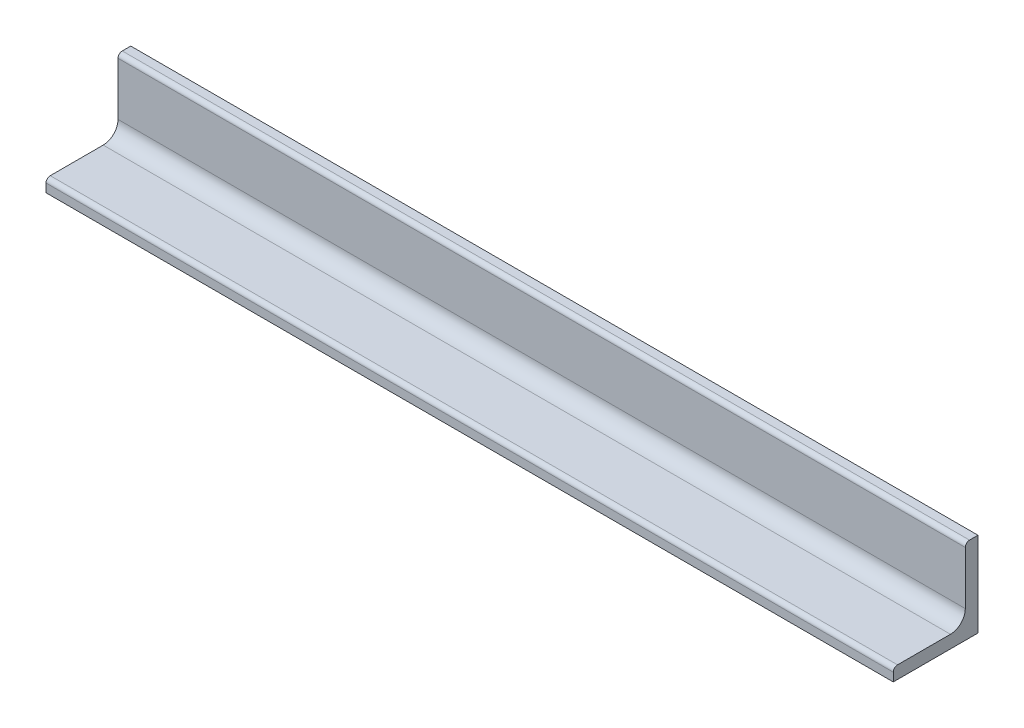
ISO-10303-21;
HEADER;
FILE_DESCRIPTION(('STEP AP214'),'2;1');
FILE_NAME('part.step','',(''),(''),'','','');
FILE_SCHEMA(('AUTOMOTIVE_DESIGN { 1 0 10303 214 1 1 1 1 }'));
ENDSEC;
DATA;
#1=APPLICATION_CONTEXT('core data for automotive mechanical design processes');
#2=APPLICATION_PROTOCOL_DEFINITION('international standard','automotive_design',2000,#1);
#3=PRODUCT_CONTEXT('',#1,'mechanical');
#4=PRODUCT('Part','Part','',(#3));
#5=PRODUCT_RELATED_PRODUCT_CATEGORY('part','',(#4));
#6=PRODUCT_DEFINITION_FORMATION('','',#4);
#7=PRODUCT_DEFINITION_CONTEXT('part definition',#1,'design');
#8=PRODUCT_DEFINITION('design','',#6,#7);
#9=PRODUCT_DEFINITION_SHAPE('','',#8);
#10=(LENGTH_UNIT() NAMED_UNIT(*) SI_UNIT(.MILLI.,.METRE.));
#11=(NAMED_UNIT(*) PLANE_ANGLE_UNIT() SI_UNIT($,.RADIAN.));
#12=(NAMED_UNIT(*) SI_UNIT($,.STERADIAN.) SOLID_ANGLE_UNIT());
#13=UNCERTAINTY_MEASURE_WITH_UNIT(LENGTH_MEASURE(1.E-05),#10,'distance_accuracy_value','');
#14=(GEOMETRIC_REPRESENTATION_CONTEXT(3) GLOBAL_UNCERTAINTY_ASSIGNED_CONTEXT((#13)) GLOBAL_UNIT_ASSIGNED_CONTEXT((#10,
#11,#12)) REPRESENTATION_CONTEXT('',''));
#15=CARTESIAN_POINT('',(0.,0.,0.));
#16=DIRECTION('',(0.,0.,1.));
#17=DIRECTION('',(1.,0.,0.));
#18=AXIS2_PLACEMENT_3D('',#15,#16,#17);
#19=CARTESIAN_POINT('',(200.,0.,20.));
#20=DIRECTION('',(0.,0.,-1.));
#21=DIRECTION('',(0.,1.,0.));
#22=AXIS2_PLACEMENT_3D('',#19,#20,#21);
#23=PLANE('',#22);
#24=DIRECTION('',(0.,-1.,0.));
#25=VECTOR('',#24,1.);
#26=CARTESIAN_POINT('',(0.,0.,20.));
#27=LINE('',#26,#25);
#28=CARTESIAN_POINT('',(0.,1.99999999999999,20.));
#29=VERTEX_POINT('',#28);
#30=CARTESIAN_POINT('',(0.,0.,20.));
#31=VERTEX_POINT('',#30);
#32=EDGE_CURVE('E135',#29,#31,#27,.T.);
#33=ORIENTED_EDGE('',*,*,#32,.T.);
#34=DIRECTION('',(-1.,0.,0.));
#35=VECTOR('',#34,1.);
#36=CARTESIAN_POINT('',(200.,0.,20.));
#37=LINE('',#36,#35);
#38=CARTESIAN_POINT('',(200.,0.,20.));
#39=VERTEX_POINT('',#38);
#40=EDGE_CURVE('E11',#39,#31,#37,.T.);
#41=ORIENTED_EDGE('',*,*,#40,.F.);
#42=DIRECTION('',(0.,-1.,0.));
#43=VECTOR('',#42,1.);
#44=CARTESIAN_POINT('',(200.,0.,20.));
#45=LINE('',#44,#43);
#46=CARTESIAN_POINT('',(200.,1.99999999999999,20.));
#47=VERTEX_POINT('',#46);
#48=EDGE_CURVE('E151',#47,#39,#45,.T.);
#49=ORIENTED_EDGE('',*,*,#48,.F.);
#50=DIRECTION('',(-1.,0.,0.));
#51=VECTOR('',#50,1.);
#52=CARTESIAN_POINT('',(200.,1.99999999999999,20.));
#53=LINE('',#52,#51);
#54=EDGE_CURVE('E131',#47,#29,#53,.T.);
#55=ORIENTED_EDGE('',*,*,#54,.T.);
#56=EDGE_LOOP('',(#33,#41,#49,#55));
#57=FACE_BOUND('',#56,.T.);
#58=ADVANCED_FACE('F33',(#57),#23,.F.);
#59=CARTESIAN_POINT('',(200.,0.,20.));
#60=DIRECTION('',(0.,1.,0.));
#61=DIRECTION('',(0.,0.,1.));
#62=AXIS2_PLACEMENT_3D('',#59,#60,#61);
#63=PLANE('',#62);
#64=DIRECTION('',(0.,0.,-1.));
#65=VECTOR('',#64,1.);
#66=CARTESIAN_POINT('',(0.,0.,20.));
#67=LINE('',#66,#65);
#68=CARTESIAN_POINT('',(0.,0.,0.));
#69=VERTEX_POINT('',#68);
#70=EDGE_CURVE('E138',#31,#69,#67,.T.);
#71=ORIENTED_EDGE('',*,*,#70,.T.);
#72=DIRECTION('',(-1.,0.,0.));
#73=VECTOR('',#72,1.);
#74=CARTESIAN_POINT('',(200.,0.,0.));
#75=LINE('',#74,#73);
#76=CARTESIAN_POINT('',(200.,0.,0.));
#77=VERTEX_POINT('',#76);
#78=EDGE_CURVE('E41',#77,#69,#75,.T.);
#79=ORIENTED_EDGE('',*,*,#78,.F.);
#80=DIRECTION('',(0.,0.,-1.));
#81=VECTOR('',#80,1.);
#82=CARTESIAN_POINT('',(200.,0.,20.));
#83=LINE('',#82,#81);
#84=EDGE_CURVE('E95',#39,#77,#83,.T.);
#85=ORIENTED_EDGE('',*,*,#84,.F.);
#86=ORIENTED_EDGE('',*,*,#40,.T.);
#87=EDGE_LOOP('',(#71,#79,#85,#86));
#88=FACE_BOUND('',#87,.T.);
#89=ADVANCED_FACE('F194',(#88),#63,.F.);
#90=CARTESIAN_POINT('',(200.,0.,0.));
#91=DIRECTION('',(0.,0.,1.));
#92=DIRECTION('',(1.,0.,0.));
#93=AXIS2_PLACEMENT_3D('',#90,#91,#92);
#94=PLANE('',#93);
#95=DIRECTION('',(0.,1.,0.));
#96=VECTOR('',#95,1.);
#97=CARTESIAN_POINT('',(0.,0.,0.));
#98=LINE('',#97,#96);
#99=CARTESIAN_POINT('',(0.,20.,0.));
#100=VERTEX_POINT('',#99);
#101=EDGE_CURVE('E140',#69,#100,#98,.T.);
#102=ORIENTED_EDGE('',*,*,#101,.T.);
#103=DIRECTION('',(-1.,0.,0.));
#104=VECTOR('',#103,1.);
#105=CARTESIAN_POINT('',(200.,20.,0.));
#106=LINE('',#105,#104);
#107=CARTESIAN_POINT('',(200.,20.,0.));
#108=VERTEX_POINT('',#107);
#109=EDGE_CURVE('E161',#108,#100,#106,.T.);
#110=ORIENTED_EDGE('',*,*,#109,.F.);
#111=DIRECTION('',(0.,1.,0.));
#112=VECTOR('',#111,1.);
#113=CARTESIAN_POINT('',(200.,0.,0.));
#114=LINE('',#113,#112);
#115=EDGE_CURVE('E169',#77,#108,#114,.T.);
#116=ORIENTED_EDGE('',*,*,#115,.F.);
#117=ORIENTED_EDGE('',*,*,#78,.T.);
#118=EDGE_LOOP('',(#102,#110,#116,#117));
#119=FACE_BOUND('',#118,.T.);
#120=ADVANCED_FACE('F167',(#119),#94,.F.);
#121=CARTESIAN_POINT('',(200.,20.,0.));
#122=DIRECTION('',(0.,-1.,0.));
#123=DIRECTION('',(0.,0.,-1.));
#124=AXIS2_PLACEMENT_3D('',#121,#122,#123);
#125=PLANE('',#124);
#126=DIRECTION('',(0.,0.,1.));
#127=VECTOR('',#126,1.);
#128=CARTESIAN_POINT('',(0.,20.,0.));
#129=LINE('',#128,#127);
#130=CARTESIAN_POINT('',(0.,20.,1.99999999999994));
#131=VERTEX_POINT('',#130);
#132=EDGE_CURVE('E142',#100,#131,#129,.T.);
#133=ORIENTED_EDGE('',*,*,#132,.T.);
#134=DIRECTION('',(-1.,0.,0.));
#135=VECTOR('',#134,1.);
#136=CARTESIAN_POINT('',(200.,20.,1.99999999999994));
#137=LINE('',#136,#135);
#138=CARTESIAN_POINT('',(200.,20.,1.99999999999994));
#139=VERTEX_POINT('',#138);
#140=EDGE_CURVE('E158',#139,#131,#137,.T.);
#141=ORIENTED_EDGE('',*,*,#140,.F.);
#142=DIRECTION('',(0.,0.,1.));
#143=VECTOR('',#142,1.);
#144=CARTESIAN_POINT('',(200.,20.,0.));
#145=LINE('',#144,#143);
#146=EDGE_CURVE('E185',#108,#139,#145,.T.);
#147=ORIENTED_EDGE('',*,*,#146,.F.);
#148=ORIENTED_EDGE('',*,*,#109,.T.);
#149=EDGE_LOOP('',(#133,#141,#147,#148));
#150=FACE_BOUND('',#149,.T.);
#151=ADVANCED_FACE('F178',(#150),#125,.F.);
#152=CARTESIAN_POINT('',(200.,19.,1.99999999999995));
#153=DIRECTION('',(-1.,0.,0.));
#154=DIRECTION('',(0.,0.,1.));
#155=AXIS2_PLACEMENT_3D('',#152,#153,#154);
#156=CYLINDRICAL_SURFACE('',#155,1.);
#157=CARTESIAN_POINT('',(0.,19.,1.99999999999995));
#158=DIRECTION('',(1.,0.,0.));
#159=DIRECTION('',(0.,0.,-1.));
#160=AXIS2_PLACEMENT_3D('',#157,#158,#159);
#161=CIRCLE('',#160,1.);
#162=CARTESIAN_POINT('',(0.,19.,2.99999999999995));
#163=VERTEX_POINT('',#162);
#164=EDGE_CURVE('E144',#131,#163,#161,.T.);
#165=ORIENTED_EDGE('',*,*,#164,.T.);
#166=DIRECTION('',(-1.,0.,0.));
#167=VECTOR('',#166,1.);
#168=CARTESIAN_POINT('',(200.,19.,2.99999999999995));
#169=LINE('',#168,#167);
#170=CARTESIAN_POINT('',(200.,19.,2.99999999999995));
#171=VERTEX_POINT('',#170);
#172=EDGE_CURVE('E155',#171,#163,#169,.T.);
#173=ORIENTED_EDGE('',*,*,#172,.F.);
#174=CARTESIAN_POINT('',(200.,19.,1.99999999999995));
#175=DIRECTION('',(1.,0.,0.));
#176=DIRECTION('',(0.,0.,-1.));
#177=AXIS2_PLACEMENT_3D('',#174,#175,#176);
#178=CIRCLE('',#177,1.);
#179=EDGE_CURVE('E184',#139,#171,#178,.T.);
#180=ORIENTED_EDGE('',*,*,#179,.F.);
#181=ORIENTED_EDGE('',*,*,#140,.T.);
#182=EDGE_LOOP('',(#165,#173,#180,#181));
#183=FACE_BOUND('',#182,.T.);
#184=ADVANCED_FACE('F182',(#183),#156,.T.);
#185=CARTESIAN_POINT('',(200.,6.50000000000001,2.99999999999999));
#186=DIRECTION('',(0.,0.,-1.));
#187=DIRECTION('',(0.,1.,0.));
#188=AXIS2_PLACEMENT_3D('',#185,#186,#187);
#189=PLANE('',#188);
#190=DIRECTION('',(0.,-1.,0.));
#191=VECTOR('',#190,1.);
#192=CARTESIAN_POINT('',(0.,6.50000000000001,2.99999999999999));
#193=LINE('',#192,#191);
#194=CARTESIAN_POINT('',(0.,6.50000000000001,2.99999999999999));
#195=VERTEX_POINT('',#194);
#196=EDGE_CURVE('E146',#163,#195,#193,.T.);
#197=ORIENTED_EDGE('',*,*,#196,.T.);
#198=DIRECTION('',(-1.,0.,0.));
#199=VECTOR('',#198,1.);
#200=CARTESIAN_POINT('',(200.,6.50000000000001,2.99999999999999));
#201=LINE('',#200,#199);
#202=CARTESIAN_POINT('',(200.,6.50000000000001,2.99999999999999));
#203=VERTEX_POINT('',#202);
#204=EDGE_CURVE('E126',#203,#195,#201,.T.);
#205=ORIENTED_EDGE('',*,*,#204,.F.);
#206=DIRECTION('',(0.,-1.,0.));
#207=VECTOR('',#206,1.);
#208=CARTESIAN_POINT('',(200.,6.50000000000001,2.99999999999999));
#209=LINE('',#208,#207);
#210=EDGE_CURVE('E117',#171,#203,#209,.T.);
#211=ORIENTED_EDGE('',*,*,#210,.F.);
#212=ORIENTED_EDGE('',*,*,#172,.T.);
#213=EDGE_LOOP('',(#197,#205,#211,#212));
#214=FACE_BOUND('',#213,.T.);
#215=ADVANCED_FACE('F206',(#214),#189,.F.);
#216=CARTESIAN_POINT('',(200.,6.5,6.49999999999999));
#217=DIRECTION('',(-1.,0.,0.));
#218=DIRECTION('',(0.,0.,1.));
#219=AXIS2_PLACEMENT_3D('',#216,#217,#218);
#220=CYLINDRICAL_SURFACE('',#219,3.5);
#221=CARTESIAN_POINT('',(0.,6.5,6.49999999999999));
#222=DIRECTION('',(-1.,0.,0.));
#223=DIRECTION('',(0.,0.,-1.));
#224=AXIS2_PLACEMENT_3D('',#221,#222,#223);
#225=CIRCLE('',#224,3.5);
#226=CARTESIAN_POINT('',(0.,3.,6.50000000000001));
#227=VERTEX_POINT('',#226);
#228=EDGE_CURVE('E125',#195,#227,#225,.T.);
#229=ORIENTED_EDGE('',*,*,#228,.T.);
#230=DIRECTION('',(-1.,0.,0.));
#231=VECTOR('',#230,1.);
#232=CARTESIAN_POINT('',(200.,3.,6.50000000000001));
#233=LINE('',#232,#231);
#234=CARTESIAN_POINT('',(200.,3.,6.50000000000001));
#235=VERTEX_POINT('',#234);
#236=EDGE_CURVE('E122',#235,#227,#233,.T.);
#237=ORIENTED_EDGE('',*,*,#236,.F.);
#238=CARTESIAN_POINT('',(200.,6.5,6.49999999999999));
#239=DIRECTION('',(-1.,0.,0.));
#240=DIRECTION('',(0.,0.,-1.));
#241=AXIS2_PLACEMENT_3D('',#238,#239,#240);
#242=CIRCLE('',#241,3.5);
#243=EDGE_CURVE('E111',#203,#235,#242,.T.);
#244=ORIENTED_EDGE('',*,*,#243,.F.);
#245=ORIENTED_EDGE('',*,*,#204,.T.);
#246=EDGE_LOOP('',(#229,#237,#244,#245));
#247=FACE_BOUND('',#246,.T.);
#248=ADVANCED_FACE('F123',(#247),#220,.F.);
#249=CARTESIAN_POINT('',(200.,3.,19.));
#250=DIRECTION('',(0.,-1.,0.));
#251=DIRECTION('',(0.,0.,-1.));
#252=AXIS2_PLACEMENT_3D('',#249,#250,#251);
#253=PLANE('',#252);
#254=DIRECTION('',(0.,0.,1.));
#255=VECTOR('',#254,1.);
#256=CARTESIAN_POINT('',(0.,3.,19.));
#257=LINE('',#256,#255);
#258=CARTESIAN_POINT('',(0.,3.,19.));
#259=VERTEX_POINT('',#258);
#260=EDGE_CURVE('E81',#227,#259,#257,.T.);
#261=ORIENTED_EDGE('',*,*,#260,.T.);
#262=DIRECTION('',(-1.,0.,0.));
#263=VECTOR('',#262,1.);
#264=CARTESIAN_POINT('',(200.,3.,19.));
#265=LINE('',#264,#263);
#266=CARTESIAN_POINT('',(200.,3.,19.));
#267=VERTEX_POINT('',#266);
#268=EDGE_CURVE('E127',#267,#259,#265,.T.);
#269=ORIENTED_EDGE('',*,*,#268,.F.);
#270=DIRECTION('',(0.,0.,1.));
#271=VECTOR('',#270,1.);
#272=CARTESIAN_POINT('',(200.,3.,19.));
#273=LINE('',#272,#271);
#274=EDGE_CURVE('E115',#235,#267,#273,.T.);
#275=ORIENTED_EDGE('',*,*,#274,.F.);
#276=ORIENTED_EDGE('',*,*,#236,.T.);
#277=EDGE_LOOP('',(#261,#269,#275,#276));
#278=FACE_BOUND('',#277,.T.);
#279=ADVANCED_FACE('F129',(#278),#253,.F.);
#280=CARTESIAN_POINT('',(200.,2.,19.));
#281=DIRECTION('',(-1.,0.,0.));
#282=DIRECTION('',(0.,0.,1.));
#283=AXIS2_PLACEMENT_3D('',#280,#281,#282);
#284=CYLINDRICAL_SURFACE('',#283,1.);
#285=CARTESIAN_POINT('',(0.,2.,19.));
#286=DIRECTION('',(1.,0.,0.));
#287=DIRECTION('',(0.,0.,1.));
#288=AXIS2_PLACEMENT_3D('',#285,#286,#287);
#289=CIRCLE('',#288,1.);
#290=EDGE_CURVE('E87',#259,#29,#289,.T.);
#291=ORIENTED_EDGE('',*,*,#290,.T.);
#292=ORIENTED_EDGE('',*,*,#54,.F.);
#293=CARTESIAN_POINT('',(200.,2.,19.));
#294=DIRECTION('',(1.,0.,0.));
#295=DIRECTION('',(0.,0.,1.));
#296=AXIS2_PLACEMENT_3D('',#293,#294,#295);
#297=CIRCLE('',#296,1.);
#298=EDGE_CURVE('E49',#267,#47,#297,.T.);
#299=ORIENTED_EDGE('',*,*,#298,.F.);
#300=ORIENTED_EDGE('',*,*,#268,.T.);
#301=EDGE_LOOP('',(#291,#292,#299,#300));
#302=FACE_BOUND('',#301,.T.);
#303=ADVANCED_FACE('F214',(#302),#284,.T.);
#304=CARTESIAN_POINT('',(200.,2.,19.));
#305=DIRECTION('',(-1.,0.,0.));
#306=DIRECTION('',(0.,0.,1.));
#307=AXIS2_PLACEMENT_3D('',#304,#305,#306);
#308=PLANE('',#307);
#309=ORIENTED_EDGE('',*,*,#48,.T.);
#310=ORIENTED_EDGE('',*,*,#84,.T.);
#311=ORIENTED_EDGE('',*,*,#115,.T.);
#312=ORIENTED_EDGE('',*,*,#146,.T.);
#313=ORIENTED_EDGE('',*,*,#179,.T.);
#314=ORIENTED_EDGE('',*,*,#210,.T.);
#315=ORIENTED_EDGE('',*,*,#243,.T.);
#316=ORIENTED_EDGE('',*,*,#274,.T.);
#317=ORIENTED_EDGE('',*,*,#298,.T.);
#318=EDGE_LOOP('',(#309,#310,#311,#312,#313,#314,#315,#316,#317));
#319=FACE_BOUND('',#318,.T.);
#320=ADVANCED_FACE('F113',(#319),#308,.F.);
#321=CARTESIAN_POINT('',(0.,2.,19.));
#322=DIRECTION('',(-1.,0.,0.));
#323=DIRECTION('',(0.,0.,1.));
#324=AXIS2_PLACEMENT_3D('',#321,#322,#323);
#325=PLANE('',#324);
#326=ORIENTED_EDGE('',*,*,#32,.F.);
#327=ORIENTED_EDGE('',*,*,#290,.F.);
#328=ORIENTED_EDGE('',*,*,#260,.F.);
#329=ORIENTED_EDGE('',*,*,#228,.F.);
#330=ORIENTED_EDGE('',*,*,#196,.F.);
#331=ORIENTED_EDGE('',*,*,#164,.F.);
#332=ORIENTED_EDGE('',*,*,#132,.F.);
#333=ORIENTED_EDGE('',*,*,#101,.F.);
#334=ORIENTED_EDGE('',*,*,#70,.F.);
#335=EDGE_LOOP('',(#326,#327,#328,#329,#330,#331,#332,#333,#334));
#336=FACE_BOUND('',#335,.T.);
#337=ADVANCED_FACE('F173',(#336),#325,.T.);
#338=CLOSED_SHELL('',(#58,#89,#120,#151,#184,#215,#248,#279,#303,#320,#337));
#339=MANIFOLD_SOLID_BREP('B2',#338);
#340=ADVANCED_BREP_SHAPE_REPRESENTATION('',(#18,#339),#14);
#341=SHAPE_DEFINITION_REPRESENTATION(#9,#340);
ENDSEC;
END-ISO-10303-21;
